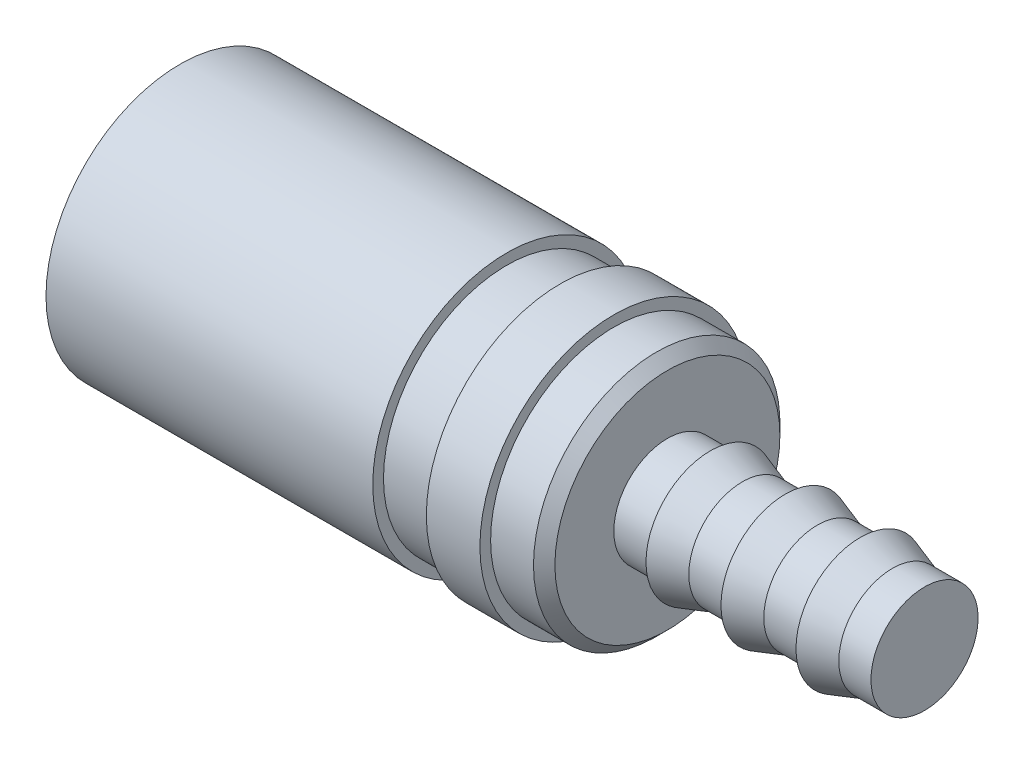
ISO-10303-21;
HEADER;
FILE_DESCRIPTION(('STEP AP214'),'2;1');
FILE_NAME('part.step','',(''),(''),'','','');
FILE_SCHEMA(('AUTOMOTIVE_DESIGN { 1 0 10303 214 1 1 1 1 }'));
ENDSEC;
DATA;
#1=APPLICATION_CONTEXT('core data for automotive mechanical design processes');
#2=APPLICATION_PROTOCOL_DEFINITION('international standard','automotive_design',2000,#1);
#3=PRODUCT_CONTEXT('',#1,'mechanical');
#4=PRODUCT('Part','Part','',(#3));
#5=PRODUCT_RELATED_PRODUCT_CATEGORY('part','',(#4));
#6=PRODUCT_DEFINITION_FORMATION('','',#4);
#7=PRODUCT_DEFINITION_CONTEXT('part definition',#1,'design');
#8=PRODUCT_DEFINITION('design','',#6,#7);
#9=PRODUCT_DEFINITION_SHAPE('','',#8);
#10=(LENGTH_UNIT() NAMED_UNIT(*) SI_UNIT(.MILLI.,.METRE.));
#11=(NAMED_UNIT(*) PLANE_ANGLE_UNIT() SI_UNIT($,.RADIAN.));
#12=(NAMED_UNIT(*) SI_UNIT($,.STERADIAN.) SOLID_ANGLE_UNIT());
#13=UNCERTAINTY_MEASURE_WITH_UNIT(LENGTH_MEASURE(1.E-05),#10,'distance_accuracy_value','');
#14=(GEOMETRIC_REPRESENTATION_CONTEXT(3) GLOBAL_UNCERTAINTY_ASSIGNED_CONTEXT((#13)) GLOBAL_UNIT_ASSIGNED_CONTEXT((#10,
#11,#12)) REPRESENTATION_CONTEXT('',''));
#15=CARTESIAN_POINT('',(0.,0.,0.));
#16=DIRECTION('',(0.,0.,1.));
#17=DIRECTION('',(1.,0.,0.));
#18=AXIS2_PLACEMENT_3D('',#15,#16,#17);
#19=CARTESIAN_POINT('',(69.5,0.,0.));
#20=DIRECTION('',(-1.,0.,0.));
#21=DIRECTION('',(0.,0.,1.));
#22=AXIS2_PLACEMENT_3D('',#19,#20,#21);
#23=PLANE('',#22);
#24=CARTESIAN_POINT('',(69.5,0.,0.));
#25=DIRECTION('',(-1.,0.,0.));
#26=DIRECTION('',(0.,0.,1.));
#27=AXIS2_PLACEMENT_3D('',#24,#25,#26);
#28=CIRCLE('',#27,5.);
#29=CARTESIAN_POINT('',(69.5,0.,5.));
#30=VERTEX_POINT('',#29);
#31=EDGE_CURVE('E42',#30,#30,#28,.T.);
#32=ORIENTED_EDGE('',*,*,#31,.F.);
#33=EDGE_LOOP('',(#32));
#34=FACE_BOUND('',#33,.T.);
#35=ADVANCED_FACE('F31',(#34),#23,.F.);
#36=CARTESIAN_POINT('',(0.,0.,0.));
#37=DIRECTION('',(-1.,0.,0.));
#38=DIRECTION('',(0.,0.,1.));
#39=AXIS2_PLACEMENT_3D('',#36,#37,#38);
#40=CYLINDRICAL_SURFACE('',#39,5.);
#41=CARTESIAN_POINT('',(66.5,0.,0.));
#42=DIRECTION('',(-1.,0.,0.));
#43=DIRECTION('',(0.,0.,1.));
#44=AXIS2_PLACEMENT_3D('',#41,#42,#43);
#45=CIRCLE('',#44,5.);
#46=CARTESIAN_POINT('',(66.5,0.,5.));
#47=VERTEX_POINT('',#46);
#48=EDGE_CURVE('E46',#47,#47,#45,.T.);
#49=ORIENTED_EDGE('',*,*,#48,.F.);
#50=EDGE_LOOP('',(#49));
#51=FACE_BOUND('',#50,.T.);
#52=ORIENTED_EDGE('',*,*,#31,.T.);
#53=EDGE_LOOP('',(#52));
#54=FACE_BOUND('',#53,.T.);
#55=ADVANCED_FACE('F148',(#51,#54),#40,.T.);
#56=CARTESIAN_POINT('',(66.5,0.,0.));
#57=DIRECTION('',(-1.,0.,0.));
#58=DIRECTION('',(0.,0.,1.));
#59=AXIS2_PLACEMENT_3D('',#56,#57,#58);
#60=CONICAL_SURFACE('',#59,5.,0.321750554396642);
#61=CARTESIAN_POINT('',(63.5,0.,0.));
#62=DIRECTION('',(-1.,0.,0.));
#63=DIRECTION('',(0.,0.,1.));
#64=AXIS2_PLACEMENT_3D('',#61,#62,#63);
#65=CIRCLE('',#64,6.);
#66=CARTESIAN_POINT('',(63.5,0.,6.));
#67=VERTEX_POINT('',#66);
#68=EDGE_CURVE('E51',#67,#67,#65,.T.);
#69=ORIENTED_EDGE('',*,*,#68,.F.);
#70=EDGE_LOOP('',(#69));
#71=FACE_BOUND('',#70,.T.);
#72=ORIENTED_EDGE('',*,*,#48,.T.);
#73=EDGE_LOOP('',(#72));
#74=FACE_BOUND('',#73,.T.);
#75=ADVANCED_FACE('F153',(#71,#74),#60,.T.);
#76=CARTESIAN_POINT('',(63.5,5.,0.));
#77=DIRECTION('',(1.,0.,0.));
#78=DIRECTION('',(0.,0.,-1.));
#79=AXIS2_PLACEMENT_3D('',#76,#77,#78);
#80=PLANE('',#79);
#81=CARTESIAN_POINT('',(63.5,0.,0.));
#82=DIRECTION('',(-1.,0.,0.));
#83=DIRECTION('',(0.,0.,1.));
#84=AXIS2_PLACEMENT_3D('',#81,#82,#83);
#85=CIRCLE('',#84,5.);
#86=CARTESIAN_POINT('',(63.5,0.,5.));
#87=VERTEX_POINT('',#86);
#88=EDGE_CURVE('E54',#87,#87,#85,.T.);
#89=ORIENTED_EDGE('',*,*,#88,.F.);
#90=EDGE_LOOP('',(#89));
#91=FACE_BOUND('',#90,.T.);
#92=ORIENTED_EDGE('',*,*,#68,.T.);
#93=EDGE_LOOP('',(#92));
#94=FACE_BOUND('',#93,.T.);
#95=ADVANCED_FACE('F160',(#91,#94),#80,.F.);
#96=CARTESIAN_POINT('',(0.,0.,0.));
#97=DIRECTION('',(-1.,0.,0.));
#98=DIRECTION('',(0.,0.,1.));
#99=AXIS2_PLACEMENT_3D('',#96,#97,#98);
#100=CYLINDRICAL_SURFACE('',#99,5.);
#101=CARTESIAN_POINT('',(59.5,0.,0.));
#102=DIRECTION('',(-1.,0.,0.));
#103=DIRECTION('',(0.,0.,1.));
#104=AXIS2_PLACEMENT_3D('',#101,#102,#103);
#105=CIRCLE('',#104,5.);
#106=CARTESIAN_POINT('',(59.5,0.,5.));
#107=VERTEX_POINT('',#106);
#108=EDGE_CURVE('E57',#107,#107,#105,.T.);
#109=ORIENTED_EDGE('',*,*,#108,.F.);
#110=EDGE_LOOP('',(#109));
#111=FACE_BOUND('',#110,.T.);
#112=ORIENTED_EDGE('',*,*,#88,.T.);
#113=EDGE_LOOP('',(#112));
#114=FACE_BOUND('',#113,.T.);
#115=ADVANCED_FACE('F164',(#111,#114),#100,.T.);
#116=CARTESIAN_POINT('',(59.5,0.,0.));
#117=DIRECTION('',(-1.,0.,0.));
#118=DIRECTION('',(0.,0.,1.));
#119=AXIS2_PLACEMENT_3D('',#116,#117,#118);
#120=CONICAL_SURFACE('',#119,5.,0.321750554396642);
#121=CARTESIAN_POINT('',(56.5,0.,0.));
#122=DIRECTION('',(-1.,0.,0.));
#123=DIRECTION('',(0.,0.,1.));
#124=AXIS2_PLACEMENT_3D('',#121,#122,#123);
#125=CIRCLE('',#124,6.);
#126=CARTESIAN_POINT('',(56.5,0.,6.));
#127=VERTEX_POINT('',#126);
#128=EDGE_CURVE('E60',#127,#127,#125,.T.);
#129=ORIENTED_EDGE('',*,*,#128,.F.);
#130=EDGE_LOOP('',(#129));
#131=FACE_BOUND('',#130,.T.);
#132=ORIENTED_EDGE('',*,*,#108,.T.);
#133=EDGE_LOOP('',(#132));
#134=FACE_BOUND('',#133,.T.);
#135=ADVANCED_FACE('F168',(#131,#134),#120,.T.);
#136=CARTESIAN_POINT('',(56.5,5.,0.));
#137=DIRECTION('',(1.,0.,0.));
#138=DIRECTION('',(0.,0.,-1.));
#139=AXIS2_PLACEMENT_3D('',#136,#137,#138);
#140=PLANE('',#139);
#141=CARTESIAN_POINT('',(56.5,0.,0.));
#142=DIRECTION('',(-1.,0.,0.));
#143=DIRECTION('',(0.,0.,1.));
#144=AXIS2_PLACEMENT_3D('',#141,#142,#143);
#145=CIRCLE('',#144,5.);
#146=CARTESIAN_POINT('',(56.5,0.,5.));
#147=VERTEX_POINT('',#146);
#148=EDGE_CURVE('E63',#147,#147,#145,.T.);
#149=ORIENTED_EDGE('',*,*,#148,.F.);
#150=EDGE_LOOP('',(#149));
#151=FACE_BOUND('',#150,.T.);
#152=ORIENTED_EDGE('',*,*,#128,.T.);
#153=EDGE_LOOP('',(#152));
#154=FACE_BOUND('',#153,.T.);
#155=ADVANCED_FACE('F172',(#151,#154),#140,.F.);
#156=CARTESIAN_POINT('',(0.,0.,0.));
#157=DIRECTION('',(-1.,0.,0.));
#158=DIRECTION('',(0.,0.,1.));
#159=AXIS2_PLACEMENT_3D('',#156,#157,#158);
#160=CYLINDRICAL_SURFACE('',#159,5.);
#161=CARTESIAN_POINT('',(52.5,0.,0.));
#162=DIRECTION('',(-1.,0.,0.));
#163=DIRECTION('',(0.,0.,1.));
#164=AXIS2_PLACEMENT_3D('',#161,#162,#163);
#165=CIRCLE('',#164,5.);
#166=CARTESIAN_POINT('',(52.5,0.,5.));
#167=VERTEX_POINT('',#166);
#168=EDGE_CURVE('E66',#167,#167,#165,.T.);
#169=ORIENTED_EDGE('',*,*,#168,.F.);
#170=EDGE_LOOP('',(#169));
#171=FACE_BOUND('',#170,.T.);
#172=ORIENTED_EDGE('',*,*,#148,.T.);
#173=EDGE_LOOP('',(#172));
#174=FACE_BOUND('',#173,.T.);
#175=ADVANCED_FACE('F176',(#171,#174),#160,.T.);
#176=CARTESIAN_POINT('',(52.5,0.,0.));
#177=DIRECTION('',(-1.,0.,0.));
#178=DIRECTION('',(0.,0.,1.));
#179=AXIS2_PLACEMENT_3D('',#176,#177,#178);
#180=CONICAL_SURFACE('',#179,5.,0.321750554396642);
#181=CARTESIAN_POINT('',(49.5,0.,0.));
#182=DIRECTION('',(-1.,0.,0.));
#183=DIRECTION('',(0.,0.,1.));
#184=AXIS2_PLACEMENT_3D('',#181,#182,#183);
#185=CIRCLE('',#184,6.);
#186=CARTESIAN_POINT('',(49.5,0.,6.));
#187=VERTEX_POINT('',#186);
#188=EDGE_CURVE('E69',#187,#187,#185,.T.);
#189=ORIENTED_EDGE('',*,*,#188,.F.);
#190=EDGE_LOOP('',(#189));
#191=FACE_BOUND('',#190,.T.);
#192=ORIENTED_EDGE('',*,*,#168,.T.);
#193=EDGE_LOOP('',(#192));
#194=FACE_BOUND('',#193,.T.);
#195=ADVANCED_FACE('F180',(#191,#194),#180,.T.);
#196=CARTESIAN_POINT('',(49.5,5.,0.));
#197=DIRECTION('',(1.,0.,0.));
#198=DIRECTION('',(0.,0.,-1.));
#199=AXIS2_PLACEMENT_3D('',#196,#197,#198);
#200=PLANE('',#199);
#201=CARTESIAN_POINT('',(49.5,0.,0.));
#202=DIRECTION('',(-1.,0.,0.));
#203=DIRECTION('',(0.,0.,1.));
#204=AXIS2_PLACEMENT_3D('',#201,#202,#203);
#205=CIRCLE('',#204,5.);
#206=CARTESIAN_POINT('',(49.5,0.,5.));
#207=VERTEX_POINT('',#206);
#208=EDGE_CURVE('E72',#207,#207,#205,.T.);
#209=ORIENTED_EDGE('',*,*,#208,.F.);
#210=EDGE_LOOP('',(#209));
#211=FACE_BOUND('',#210,.T.);
#212=ORIENTED_EDGE('',*,*,#188,.T.);
#213=EDGE_LOOP('',(#212));
#214=FACE_BOUND('',#213,.T.);
#215=ADVANCED_FACE('F184',(#211,#214),#200,.F.);
#216=CARTESIAN_POINT('',(0.,0.,0.));
#217=DIRECTION('',(-1.,0.,0.));
#218=DIRECTION('',(0.,0.,1.));
#219=AXIS2_PLACEMENT_3D('',#216,#217,#218);
#220=CYLINDRICAL_SURFACE('',#219,5.);
#221=CARTESIAN_POINT('',(45.5,0.,0.));
#222=DIRECTION('',(-1.,0.,0.));
#223=DIRECTION('',(0.,0.,1.));
#224=AXIS2_PLACEMENT_3D('',#221,#222,#223);
#225=CIRCLE('',#224,5.);
#226=CARTESIAN_POINT('',(45.5,0.,5.));
#227=VERTEX_POINT('',#226);
#228=EDGE_CURVE('E75',#227,#227,#225,.T.);
#229=ORIENTED_EDGE('',*,*,#228,.F.);
#230=EDGE_LOOP('',(#229));
#231=FACE_BOUND('',#230,.T.);
#232=ORIENTED_EDGE('',*,*,#208,.T.);
#233=EDGE_LOOP('',(#232));
#234=FACE_BOUND('',#233,.T.);
#235=ADVANCED_FACE('F145',(#231,#234),#220,.T.);
#236=CARTESIAN_POINT('',(45.5,11.5,0.));
#237=DIRECTION('',(-1.,0.,0.));
#238=DIRECTION('',(0.,0.,1.));
#239=AXIS2_PLACEMENT_3D('',#236,#237,#238);
#240=PLANE('',#239);
#241=CARTESIAN_POINT('',(45.5,0.,0.));
#242=DIRECTION('',(-1.,0.,0.));
#243=DIRECTION('',(0.,0.,1.));
#244=AXIS2_PLACEMENT_3D('',#241,#242,#243);
#245=CIRCLE('',#244,10.5);
#246=CARTESIAN_POINT('',(45.5,0.,10.5));
#247=VERTEX_POINT('',#246);
#248=EDGE_CURVE('E10',#247,#247,#245,.F.);
#249=ORIENTED_EDGE('',*,*,#248,.T.);
#250=EDGE_LOOP('',(#249));
#251=FACE_BOUND('',#250,.T.);
#252=ORIENTED_EDGE('',*,*,#228,.T.);
#253=EDGE_LOOP('',(#252));
#254=FACE_BOUND('',#253,.T.);
#255=ADVANCED_FACE('F140',(#251,#254),#240,.F.);
#256=CARTESIAN_POINT('',(0.,0.,0.));
#257=DIRECTION('',(-1.,0.,0.));
#258=DIRECTION('',(0.,0.,1.));
#259=AXIS2_PLACEMENT_3D('',#256,#257,#258);
#260=CYLINDRICAL_SURFACE('',#259,11.5);
#261=CARTESIAN_POINT('',(44.5,0.,0.));
#262=DIRECTION('',(-1.,0.,0.));
#263=DIRECTION('',(0.,0.,1.));
#264=AXIS2_PLACEMENT_3D('',#261,#262,#263);
#265=CIRCLE('',#264,11.5);
#266=CARTESIAN_POINT('',(44.5,0.,11.5));
#267=VERTEX_POINT('',#266);
#268=EDGE_CURVE('E38',#267,#267,#265,.T.);
#269=ORIENTED_EDGE('',*,*,#268,.T.);
#270=EDGE_LOOP('',(#269));
#271=FACE_BOUND('',#270,.T.);
#272=CARTESIAN_POINT('',(40.5,0.,0.));
#273=DIRECTION('',(-1.,0.,0.));
#274=DIRECTION('',(0.,0.,1.));
#275=AXIS2_PLACEMENT_3D('',#272,#273,#274);
#276=CIRCLE('',#275,11.5);
#277=CARTESIAN_POINT('',(40.5,0.,11.5));
#278=VERTEX_POINT('',#277);
#279=EDGE_CURVE('E78',#278,#278,#276,.T.);
#280=ORIENTED_EDGE('',*,*,#279,.F.);
#281=EDGE_LOOP('',(#280));
#282=FACE_BOUND('',#281,.T.);
#283=ADVANCED_FACE('F135',(#271,#282),#260,.T.);
#284=CARTESIAN_POINT('',(40.5,12.5,0.));
#285=DIRECTION('',(-1.,0.,0.));
#286=DIRECTION('',(0.,0.,1.));
#287=AXIS2_PLACEMENT_3D('',#284,#285,#286);
#288=PLANE('',#287);
#289=CARTESIAN_POINT('',(40.5,0.,0.));
#290=DIRECTION('',(-1.,0.,0.));
#291=DIRECTION('',(0.,0.,1.));
#292=AXIS2_PLACEMENT_3D('',#289,#290,#291);
#293=CIRCLE('',#292,12.5);
#294=CARTESIAN_POINT('',(40.5,0.,12.5));
#295=VERTEX_POINT('',#294);
#296=EDGE_CURVE('E81',#295,#295,#293,.T.);
#297=ORIENTED_EDGE('',*,*,#296,.F.);
#298=EDGE_LOOP('',(#297));
#299=FACE_BOUND('',#298,.T.);
#300=ORIENTED_EDGE('',*,*,#279,.T.);
#301=EDGE_LOOP('',(#300));
#302=FACE_BOUND('',#301,.T.);
#303=ADVANCED_FACE('F129',(#299,#302),#288,.F.);
#304=CARTESIAN_POINT('',(0.,0.,0.));
#305=DIRECTION('',(-1.,0.,0.));
#306=DIRECTION('',(0.,0.,1.));
#307=AXIS2_PLACEMENT_3D('',#304,#305,#306);
#308=CYLINDRICAL_SURFACE('',#307,12.5);
#309=CARTESIAN_POINT('',(35.5,0.,0.));
#310=DIRECTION('',(-1.,0.,0.));
#311=DIRECTION('',(0.,0.,1.));
#312=AXIS2_PLACEMENT_3D('',#309,#310,#311);
#313=CIRCLE('',#312,12.5);
#314=CARTESIAN_POINT('',(35.5,0.,12.5));
#315=VERTEX_POINT('',#314);
#316=EDGE_CURVE('E84',#315,#315,#313,.T.);
#317=ORIENTED_EDGE('',*,*,#316,.F.);
#318=EDGE_LOOP('',(#317));
#319=FACE_BOUND('',#318,.T.);
#320=ORIENTED_EDGE('',*,*,#296,.T.);
#321=EDGE_LOOP('',(#320));
#322=FACE_BOUND('',#321,.T.);
#323=ADVANCED_FACE('F123',(#319,#322),#308,.T.);
#324=CARTESIAN_POINT('',(35.5,11.5,0.));
#325=DIRECTION('',(1.,0.,0.));
#326=DIRECTION('',(0.,0.,-1.));
#327=AXIS2_PLACEMENT_3D('',#324,#325,#326);
#328=PLANE('',#327);
#329=CARTESIAN_POINT('',(35.5,0.,0.));
#330=DIRECTION('',(-1.,0.,0.));
#331=DIRECTION('',(0.,0.,1.));
#332=AXIS2_PLACEMENT_3D('',#329,#330,#331);
#333=CIRCLE('',#332,11.5);
#334=CARTESIAN_POINT('',(35.5,0.,11.5));
#335=VERTEX_POINT('',#334);
#336=EDGE_CURVE('E87',#335,#335,#333,.T.);
#337=ORIENTED_EDGE('',*,*,#336,.F.);
#338=EDGE_LOOP('',(#337));
#339=FACE_BOUND('',#338,.T.);
#340=ORIENTED_EDGE('',*,*,#316,.T.);
#341=EDGE_LOOP('',(#340));
#342=FACE_BOUND('',#341,.T.);
#343=ADVANCED_FACE('F117',(#339,#342),#328,.F.);
#344=CARTESIAN_POINT('',(0.,0.,0.));
#345=DIRECTION('',(-1.,0.,0.));
#346=DIRECTION('',(0.,0.,1.));
#347=AXIS2_PLACEMENT_3D('',#344,#345,#346);
#348=CYLINDRICAL_SURFACE('',#347,11.5);
#349=CARTESIAN_POINT('',(30.5,0.,0.));
#350=DIRECTION('',(-1.,0.,0.));
#351=DIRECTION('',(0.,0.,1.));
#352=AXIS2_PLACEMENT_3D('',#349,#350,#351);
#353=CIRCLE('',#352,11.5);
#354=CARTESIAN_POINT('',(30.5,0.,11.5));
#355=VERTEX_POINT('',#354);
#356=EDGE_CURVE('E90',#355,#355,#353,.T.);
#357=ORIENTED_EDGE('',*,*,#356,.F.);
#358=EDGE_LOOP('',(#357));
#359=FACE_BOUND('',#358,.T.);
#360=ORIENTED_EDGE('',*,*,#336,.T.);
#361=EDGE_LOOP('',(#360));
#362=FACE_BOUND('',#361,.T.);
#363=ADVANCED_FACE('F111',(#359,#362),#348,.T.);
#364=CARTESIAN_POINT('',(30.5,12.5,0.));
#365=DIRECTION('',(-1.,0.,0.));
#366=DIRECTION('',(0.,0.,1.));
#367=AXIS2_PLACEMENT_3D('',#364,#365,#366);
#368=PLANE('',#367);
#369=CARTESIAN_POINT('',(30.5,0.,0.));
#370=DIRECTION('',(-1.,0.,0.));
#371=DIRECTION('',(0.,0.,1.));
#372=AXIS2_PLACEMENT_3D('',#369,#370,#371);
#373=CIRCLE('',#372,12.5);
#374=CARTESIAN_POINT('',(30.5,0.,12.5));
#375=VERTEX_POINT('',#374);
#376=EDGE_CURVE('E93',#375,#375,#373,.T.);
#377=ORIENTED_EDGE('',*,*,#376,.F.);
#378=EDGE_LOOP('',(#377));
#379=FACE_BOUND('',#378,.T.);
#380=ORIENTED_EDGE('',*,*,#356,.T.);
#381=EDGE_LOOP('',(#380));
#382=FACE_BOUND('',#381,.T.);
#383=ADVANCED_FACE('F105',(#379,#382),#368,.F.);
#384=CARTESIAN_POINT('',(0.,0.,0.));
#385=DIRECTION('',(-1.,0.,0.));
#386=DIRECTION('',(0.,0.,1.));
#387=AXIS2_PLACEMENT_3D('',#384,#385,#386);
#388=CYLINDRICAL_SURFACE('',#387,12.5);
#389=CARTESIAN_POINT('',(0.,0.,0.));
#390=DIRECTION('',(-1.,0.,0.));
#391=DIRECTION('',(0.,0.,1.));
#392=AXIS2_PLACEMENT_3D('',#389,#390,#391);
#393=CIRCLE('',#392,12.5);
#394=CARTESIAN_POINT('',(0.,0.,12.5));
#395=VERTEX_POINT('',#394);
#396=EDGE_CURVE('E96',#395,#395,#393,.T.);
#397=ORIENTED_EDGE('',*,*,#396,.F.);
#398=EDGE_LOOP('',(#397));
#399=FACE_BOUND('',#398,.T.);
#400=ORIENTED_EDGE('',*,*,#376,.T.);
#401=EDGE_LOOP('',(#400));
#402=FACE_BOUND('',#401,.T.);
#403=ADVANCED_FACE('F102',(#399,#402),#388,.T.);
#404=CARTESIAN_POINT('',(0.,0.,0.));
#405=DIRECTION('',(1.,0.,0.));
#406=DIRECTION('',(0.,0.,-1.));
#407=AXIS2_PLACEMENT_3D('',#404,#405,#406);
#408=PLANE('',#407);
#409=ORIENTED_EDGE('',*,*,#396,.T.);
#410=EDGE_LOOP('',(#409));
#411=FACE_BOUND('',#410,.T.);
#412=ADVANCED_FACE('F100',(#411),#408,.F.);
#413=CARTESIAN_POINT('',(44.5,0.,0.));
#414=DIRECTION('',(-1.,0.,0.));
#415=DIRECTION('',(0.,0.,1.));
#416=AXIS2_PLACEMENT_3D('',#413,#414,#415);
#417=CONICAL_SURFACE('',#416,11.5,0.785398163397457);
#418=ORIENTED_EDGE('',*,*,#248,.F.);
#419=EDGE_LOOP('',(#418));
#420=FACE_BOUND('',#419,.T.);
#421=ORIENTED_EDGE('',*,*,#268,.F.);
#422=EDGE_LOOP('',(#421));
#423=FACE_BOUND('',#422,.T.);
#424=ADVANCED_FACE('F33',(#420,#423),#417,.T.);
#425=CLOSED_SHELL('',(#35,#55,#75,#95,#115,#135,#155,#175,#195,#215,#235,#255,#283,#303,#323,
#343,#363,#383,#403,#412,#424));
#426=MANIFOLD_SOLID_BREP('B2',#425);
#427=ADVANCED_BREP_SHAPE_REPRESENTATION('',(#18,#426),#14);
#428=SHAPE_DEFINITION_REPRESENTATION(#9,#427);
ENDSEC;
END-ISO-10303-21;
